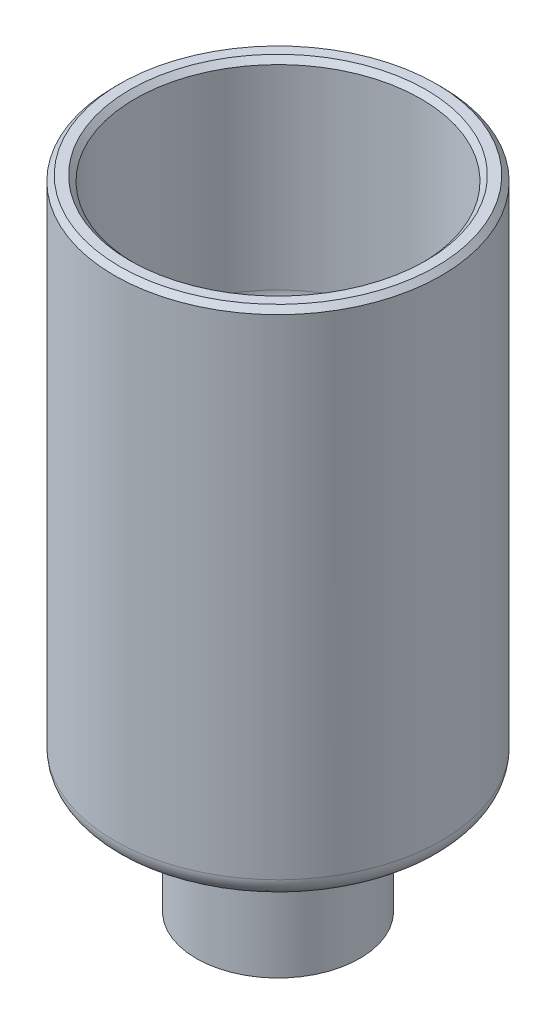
ISO-10303-21;
HEADER;
FILE_DESCRIPTION(('STEP AP214'),'2;1');
FILE_NAME('part.step','',(''),(''),'','','');
FILE_SCHEMA(('AUTOMOTIVE_DESIGN { 1 0 10303 214 1 1 1 1 }'));
ENDSEC;
DATA;
#1=APPLICATION_CONTEXT('core data for automotive mechanical design processes');
#2=APPLICATION_PROTOCOL_DEFINITION('international standard','automotive_design',2000,#1);
#3=PRODUCT_CONTEXT('',#1,'mechanical');
#4=PRODUCT('Part','Part','',(#3));
#5=PRODUCT_RELATED_PRODUCT_CATEGORY('part','',(#4));
#6=PRODUCT_DEFINITION_FORMATION('','',#4);
#7=PRODUCT_DEFINITION_CONTEXT('part definition',#1,'design');
#8=PRODUCT_DEFINITION('design','',#6,#7);
#9=PRODUCT_DEFINITION_SHAPE('','',#8);
#10=(LENGTH_UNIT() NAMED_UNIT(*) SI_UNIT(.MILLI.,.METRE.));
#11=(NAMED_UNIT(*) PLANE_ANGLE_UNIT() SI_UNIT($,.RADIAN.));
#12=(NAMED_UNIT(*) SI_UNIT($,.STERADIAN.) SOLID_ANGLE_UNIT());
#13=UNCERTAINTY_MEASURE_WITH_UNIT(LENGTH_MEASURE(1.E-05),#10,'distance_accuracy_value','');
#14=(GEOMETRIC_REPRESENTATION_CONTEXT(3) GLOBAL_UNCERTAINTY_ASSIGNED_CONTEXT((#13)) GLOBAL_UNIT_ASSIGNED_CONTEXT((#10,
#11,#12)) REPRESENTATION_CONTEXT('',''));
#15=CARTESIAN_POINT('',(0.,0.,0.));
#16=DIRECTION('',(0.,0.,1.));
#17=DIRECTION('',(1.,0.,0.));
#18=AXIS2_PLACEMENT_3D('',#15,#16,#17);
#19=CARTESIAN_POINT('',(1.7907,0.,0.));
#20=DIRECTION('',(0.,1.,0.));
#21=DIRECTION('',(0.,0.,1.));
#22=AXIS2_PLACEMENT_3D('',#19,#20,#21);
#23=PLANE('',#22);
#24=CARTESIAN_POINT('',(2.286,0.,0.));
#25=DIRECTION('',(0.,-1.,0.));
#26=DIRECTION('',(0.,0.,-1.));
#27=AXIS2_PLACEMENT_3D('',#24,#25,#26);
#28=CIRCLE('',#27,0.3175);
#29=CARTESIAN_POINT('',(2.286,0.,-0.3175));
#30=VERTEX_POINT('',#29);
#31=EDGE_CURVE('E96',#30,#30,#28,.T.);
#32=ORIENTED_EDGE('',*,*,#31,.F.);
#33=EDGE_LOOP('',(#32));
#34=FACE_BOUND('',#33,.T.);
#35=CARTESIAN_POINT('',(0.,0.,0.));
#36=DIRECTION('',(0.,1.,0.));
#37=DIRECTION('',(0.,0.,1.));
#38=AXIS2_PLACEMENT_3D('',#35,#36,#37);
#39=CIRCLE('',#38,3.175);
#40=CARTESIAN_POINT('',(0.,0.,3.175));
#41=VERTEX_POINT('',#40);
#42=EDGE_CURVE('E92',#41,#41,#39,.T.);
#43=ORIENTED_EDGE('',*,*,#42,.F.);
#44=EDGE_LOOP('',(#43));
#45=FACE_BOUND('',#44,.T.);
#46=CARTESIAN_POINT('',(0.,0.,0.));
#47=DIRECTION('',(0.,1.,0.));
#48=DIRECTION('',(0.,0.,1.));
#49=AXIS2_PLACEMENT_3D('',#46,#47,#48);
#50=CIRCLE('',#49,1.7907);
#51=CARTESIAN_POINT('',(0.,0.,1.7907));
#52=VERTEX_POINT('',#51);
#53=EDGE_CURVE('E50',#52,#52,#50,.T.);
#54=ORIENTED_EDGE('',*,*,#53,.T.);
#55=EDGE_LOOP('',(#54));
#56=FACE_BOUND('',#55,.T.);
#57=ADVANCED_FACE('F30',(#34,#45,#56),#23,.F.);
#58=CARTESIAN_POINT('',(0.,0.,0.));
#59=DIRECTION('',(0.,1.,0.));
#60=DIRECTION('',(0.,0.,1.));
#61=AXIS2_PLACEMENT_3D('',#58,#59,#60);
#62=CYLINDRICAL_SURFACE('',#61,1.7907);
#63=ORIENTED_EDGE('',*,*,#53,.F.);
#64=EDGE_LOOP('',(#63));
#65=FACE_BOUND('',#64,.T.);
#66=CARTESIAN_POINT('',(0.,8.25871274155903,0.));
#67=DIRECTION('',(0.,1.,0.));
#68=DIRECTION('',(0.,0.,1.));
#69=AXIS2_PLACEMENT_3D('',#66,#67,#68);
#70=CIRCLE('',#69,1.7907);
#71=CARTESIAN_POINT('',(0.,8.25871274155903,1.7907));
#72=VERTEX_POINT('',#71);
#73=EDGE_CURVE('E53',#72,#72,#70,.T.);
#74=ORIENTED_EDGE('',*,*,#73,.T.);
#75=EDGE_LOOP('',(#74));
#76=FACE_BOUND('',#75,.T.);
#77=ADVANCED_FACE('F113',(#65,#76),#62,.F.);
#78=CARTESIAN_POINT('',(0.,9.8425,0.));
#79=DIRECTION('',(0.,1.,0.));
#80=DIRECTION('',(0.,0.,1.));
#81=AXIS2_PLACEMENT_3D('',#78,#79,#80);
#82=CONICAL_SURFACE('',#81,2.7051,0.5235987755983);
#83=ORIENTED_EDGE('',*,*,#73,.F.);
#84=EDGE_LOOP('',(#83));
#85=FACE_BOUND('',#84,.T.);
#86=CARTESIAN_POINT('',(0.,9.8425,0.));
#87=DIRECTION('',(0.,1.,0.));
#88=DIRECTION('',(0.,0.,1.));
#89=AXIS2_PLACEMENT_3D('',#86,#87,#88);
#90=CIRCLE('',#89,2.7051);
#91=CARTESIAN_POINT('',(0.,9.8425,2.7051));
#92=VERTEX_POINT('',#91);
#93=EDGE_CURVE('E56',#92,#92,#90,.T.);
#94=ORIENTED_EDGE('',*,*,#93,.T.);
#95=EDGE_LOOP('',(#94));
#96=FACE_BOUND('',#95,.T.);
#97=ADVANCED_FACE('F121',(#85,#96),#82,.F.);
#98=CARTESIAN_POINT('',(0.,0.,0.));
#99=DIRECTION('',(0.,1.,0.));
#100=DIRECTION('',(0.,0.,1.));
#101=AXIS2_PLACEMENT_3D('',#98,#99,#100);
#102=CYLINDRICAL_SURFACE('',#101,2.7051);
#103=ORIENTED_EDGE('',*,*,#93,.F.);
#104=EDGE_LOOP('',(#103));
#105=FACE_BOUND('',#104,.T.);
#106=CARTESIAN_POINT('',(0.,16.1925,0.));
#107=DIRECTION('',(0.,1.,0.));
#108=DIRECTION('',(0.,0.,1.));
#109=AXIS2_PLACEMENT_3D('',#106,#107,#108);
#110=CIRCLE('',#109,2.7051);
#111=CARTESIAN_POINT('',(0.,16.1925,2.7051));
#112=VERTEX_POINT('',#111);
#113=EDGE_CURVE('E59',#112,#112,#110,.T.);
#114=ORIENTED_EDGE('',*,*,#113,.T.);
#115=EDGE_LOOP('',(#114));
#116=FACE_BOUND('',#115,.T.);
#117=ADVANCED_FACE('F127',(#105,#116),#102,.F.);
#118=CARTESIAN_POINT('',(2.7051,16.1925,0.));
#119=DIRECTION('',(0.,-1.,0.));
#120=DIRECTION('',(0.,0.,-1.));
#121=AXIS2_PLACEMENT_3D('',#118,#119,#120);
#122=PLANE('',#121);
#123=ORIENTED_EDGE('',*,*,#113,.F.);
#124=EDGE_LOOP('',(#123));
#125=FACE_BOUND('',#124,.T.);
#126=CARTESIAN_POINT('',(0.,16.1925,0.));
#127=DIRECTION('',(0.,1.,0.));
#128=DIRECTION('',(0.,0.,1.));
#129=AXIS2_PLACEMENT_3D('',#126,#127,#128);
#130=CIRCLE('',#129,4.7625);
#131=CARTESIAN_POINT('',(0.,16.1925,4.7625));
#132=VERTEX_POINT('',#131);
#133=EDGE_CURVE('E62',#132,#132,#130,.T.);
#134=ORIENTED_EDGE('',*,*,#133,.T.);
#135=EDGE_LOOP('',(#134));
#136=FACE_BOUND('',#135,.T.);
#137=ADVANCED_FACE('F133',(#125,#136),#122,.F.);
#138=CARTESIAN_POINT('',(0.,16.9799,0.));
#139=DIRECTION('',(0.,1.,0.));
#140=DIRECTION('',(0.,0.,1.));
#141=AXIS2_PLACEMENT_3D('',#138,#139,#140);
#142=TOROIDAL_SURFACE('',#141,4.7625,0.7874);
#143=ORIENTED_EDGE('',*,*,#133,.F.);
#144=EDGE_LOOP('',(#143));
#145=FACE_BOUND('',#144,.T.);
#146=CARTESIAN_POINT('',(0.,16.9799,0.));
#147=DIRECTION('',(0.,1.,0.));
#148=DIRECTION('',(0.,0.,1.));
#149=AXIS2_PLACEMENT_3D('',#146,#147,#148);
#150=CIRCLE('',#149,5.5499);
#151=CARTESIAN_POINT('',(0.,16.9799,5.5499));
#152=VERTEX_POINT('',#151);
#153=EDGE_CURVE('E65',#152,#152,#150,.T.);
#154=ORIENTED_EDGE('',*,*,#153,.T.);
#155=EDGE_LOOP('',(#154));
#156=FACE_BOUND('',#155,.T.);
#157=ADVANCED_FACE('F139',(#145,#156),#142,.F.);
#158=CARTESIAN_POINT('',(0.,0.,0.));
#159=DIRECTION('',(0.,1.,0.));
#160=DIRECTION('',(0.,0.,1.));
#161=AXIS2_PLACEMENT_3D('',#158,#159,#160);
#162=CYLINDRICAL_SURFACE('',#161,5.5499);
#163=CARTESIAN_POINT('',(0.,24.5618,0.));
#164=DIRECTION('',(0.,-1.,0.));
#165=DIRECTION('',(0.,0.,-1.));
#166=AXIS2_PLACEMENT_3D('',#163,#164,#165);
#167=CIRCLE('',#166,5.5499);
#168=CARTESIAN_POINT('',(0.,24.5618,-5.5499));
#169=VERTEX_POINT('',#168);
#170=EDGE_CURVE('E10',#169,#169,#167,.F.);
#171=ORIENTED_EDGE('',*,*,#170,.T.);
#172=EDGE_LOOP('',(#171));
#173=FACE_BOUND('',#172,.T.);
#174=ORIENTED_EDGE('',*,*,#153,.F.);
#175=EDGE_LOOP('',(#174));
#176=FACE_BOUND('',#175,.T.);
#177=ADVANCED_FACE('F145',(#173,#176),#162,.F.);
#178=CARTESIAN_POINT('',(5.5499,24.765,0.));
#179=DIRECTION('',(0.,-1.,0.));
#180=DIRECTION('',(0.,0.,-1.));
#181=AXIS2_PLACEMENT_3D('',#178,#179,#180);
#182=PLANE('',#181);
#183=CARTESIAN_POINT('',(0.,24.765,0.));
#184=DIRECTION('',(0.,-1.,0.));
#185=DIRECTION('',(0.,0.,-1.));
#186=AXIS2_PLACEMENT_3D('',#183,#184,#185);
#187=CIRCLE('',#186,6.14679999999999);
#188=CARTESIAN_POINT('',(0.,24.765,-6.14679999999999));
#189=VERTEX_POINT('',#188);
#190=EDGE_CURVE('E41',#189,#189,#187,.F.);
#191=ORIENTED_EDGE('',*,*,#190,.T.);
#192=EDGE_LOOP('',(#191));
#193=FACE_BOUND('',#192,.T.);
#194=CARTESIAN_POINT('',(0.,24.765,0.));
#195=DIRECTION('',(0.,-1.,0.));
#196=DIRECTION('',(0.,0.,-1.));
#197=AXIS2_PLACEMENT_3D('',#194,#195,#196);
#198=CIRCLE('',#197,5.7531);
#199=CARTESIAN_POINT('',(0.,24.765,-5.7531));
#200=VERTEX_POINT('',#199);
#201=EDGE_CURVE('E45',#200,#200,#198,.T.);
#202=ORIENTED_EDGE('',*,*,#201,.T.);
#203=EDGE_LOOP('',(#202));
#204=FACE_BOUND('',#203,.T.);
#205=ADVANCED_FACE('F150',(#193,#204),#182,.F.);
#206=CARTESIAN_POINT('',(0.,0.,0.));
#207=DIRECTION('',(0.,1.,0.));
#208=DIRECTION('',(0.,0.,1.));
#209=AXIS2_PLACEMENT_3D('',#206,#207,#208);
#210=CYLINDRICAL_SURFACE('',#209,6.35);
#211=CARTESIAN_POINT('',(0.,24.5618,0.));
#212=DIRECTION('',(0.,-1.,0.));
#213=DIRECTION('',(0.,0.,-1.));
#214=AXIS2_PLACEMENT_3D('',#211,#212,#213);
#215=CIRCLE('',#214,6.35);
#216=CARTESIAN_POINT('',(0.,24.5618,-6.35));
#217=VERTEX_POINT('',#216);
#218=EDGE_CURVE('E37',#217,#217,#215,.T.);
#219=ORIENTED_EDGE('',*,*,#218,.T.);
#220=EDGE_LOOP('',(#219));
#221=FACE_BOUND('',#220,.T.);
#222=CARTESIAN_POINT('',(0.,5.5499,0.));
#223=DIRECTION('',(0.,1.,0.));
#224=DIRECTION('',(0.,0.,1.));
#225=AXIS2_PLACEMENT_3D('',#222,#223,#224);
#226=CIRCLE('',#225,6.35);
#227=CARTESIAN_POINT('',(0.,5.5499,6.35));
#228=VERTEX_POINT('',#227);
#229=EDGE_CURVE('E68',#228,#228,#226,.T.);
#230=ORIENTED_EDGE('',*,*,#229,.T.);
#231=EDGE_LOOP('',(#230));
#232=FACE_BOUND('',#231,.T.);
#233=ADVANCED_FACE('F155',(#221,#232),#210,.T.);
#234=CARTESIAN_POINT('',(0.,5.5499,0.));
#235=DIRECTION('',(0.,1.,0.));
#236=DIRECTION('',(0.,0.,1.));
#237=AXIS2_PLACEMENT_3D('',#234,#235,#236);
#238=TOROIDAL_SURFACE('',#237,5.5626,0.7874);
#239=ORIENTED_EDGE('',*,*,#229,.F.);
#240=EDGE_LOOP('',(#239));
#241=FACE_BOUND('',#240,.T.);
#242=CARTESIAN_POINT('',(0.,4.86799159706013,0.));
#243=DIRECTION('',(0.,1.,0.));
#244=DIRECTION('',(0.,0.,1.));
#245=AXIS2_PLACEMENT_3D('',#242,#243,#244);
#246=CIRCLE('',#245,5.9563);
#247=CARTESIAN_POINT('',(0.,4.86799159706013,5.9563));
#248=VERTEX_POINT('',#247);
#249=EDGE_CURVE('E71',#248,#248,#246,.T.);
#250=ORIENTED_EDGE('',*,*,#249,.T.);
#251=EDGE_LOOP('',(#250));
#252=FACE_BOUND('',#251,.T.);
#253=ADVANCED_FACE('F202',(#241,#252),#238,.T.);
#254=CARTESIAN_POINT('',(0.,0.,0.));
#255=DIRECTION('',(0.,1.,0.));
#256=DIRECTION('',(0.,0.,1.));
#257=AXIS2_PLACEMENT_3D('',#254,#255,#256);
#258=CYLINDRICAL_SURFACE('',#257,5.9563);
#259=ORIENTED_EDGE('',*,*,#249,.F.);
#260=EDGE_LOOP('',(#259));
#261=FACE_BOUND('',#260,.T.);
#262=CARTESIAN_POINT('',(0.,6.0325,0.));
#263=DIRECTION('',(0.,1.,0.));
#264=DIRECTION('',(0.,0.,1.));
#265=AXIS2_PLACEMENT_3D('',#262,#263,#264);
#266=CIRCLE('',#265,5.9563);
#267=CARTESIAN_POINT('',(0.,6.0325,5.9563));
#268=VERTEX_POINT('',#267);
#269=EDGE_CURVE('E74',#268,#268,#266,.T.);
#270=ORIENTED_EDGE('',*,*,#269,.T.);
#271=EDGE_LOOP('',(#270));
#272=FACE_BOUND('',#271,.T.);
#273=ADVANCED_FACE('F198',(#261,#272),#258,.F.);
#274=CARTESIAN_POINT('',(3.8227,6.0325,0.));
#275=DIRECTION('',(0.,1.,0.));
#276=DIRECTION('',(0.,0.,1.));
#277=AXIS2_PLACEMENT_3D('',#274,#275,#276);
#278=PLANE('',#277);
#279=ORIENTED_EDGE('',*,*,#269,.F.);
#280=EDGE_LOOP('',(#279));
#281=FACE_BOUND('',#280,.T.);
#282=CARTESIAN_POINT('',(0.,6.0325,0.));
#283=DIRECTION('',(0.,1.,0.));
#284=DIRECTION('',(0.,0.,1.));
#285=AXIS2_PLACEMENT_3D('',#282,#283,#284);
#286=CIRCLE('',#285,3.8227);
#287=CARTESIAN_POINT('',(0.,6.0325,3.8227));
#288=VERTEX_POINT('',#287);
#289=EDGE_CURVE('E77',#288,#288,#286,.T.);
#290=ORIENTED_EDGE('',*,*,#289,.T.);
#291=EDGE_LOOP('',(#290));
#292=FACE_BOUND('',#291,.T.);
#293=ADVANCED_FACE('F194',(#281,#292),#278,.F.);
#294=CARTESIAN_POINT('',(0.,0.,0.));
#295=DIRECTION('',(0.,1.,0.));
#296=DIRECTION('',(0.,0.,1.));
#297=AXIS2_PLACEMENT_3D('',#294,#295,#296);
#298=CYLINDRICAL_SURFACE('',#297,3.8227);
#299=ORIENTED_EDGE('',*,*,#289,.F.);
#300=EDGE_LOOP('',(#299));
#301=FACE_BOUND('',#300,.T.);
#302=CARTESIAN_POINT('',(0.,4.7625,0.));
#303=DIRECTION('',(0.,1.,0.));
#304=DIRECTION('',(0.,0.,1.));
#305=AXIS2_PLACEMENT_3D('',#302,#303,#304);
#306=CIRCLE('',#305,3.8227);
#307=CARTESIAN_POINT('',(0.,4.7625,3.8227));
#308=VERTEX_POINT('',#307);
#309=EDGE_CURVE('E80',#308,#308,#306,.T.);
#310=ORIENTED_EDGE('',*,*,#309,.T.);
#311=EDGE_LOOP('',(#310));
#312=FACE_BOUND('',#311,.T.);
#313=ADVANCED_FACE('F190',(#301,#312),#298,.T.);
#314=CARTESIAN_POINT('',(3.8227,4.7625,0.));
#315=DIRECTION('',(0.,1.,0.));
#316=DIRECTION('',(0.,0.,1.));
#317=AXIS2_PLACEMENT_3D('',#314,#315,#316);
#318=PLANE('',#317);
#319=ORIENTED_EDGE('',*,*,#309,.F.);
#320=EDGE_LOOP('',(#319));
#321=FACE_BOUND('',#320,.T.);
#322=CARTESIAN_POINT('',(0.,4.7625,0.));
#323=DIRECTION('',(0.,1.,0.));
#324=DIRECTION('',(0.,0.,1.));
#325=AXIS2_PLACEMENT_3D('',#322,#323,#324);
#326=CIRCLE('',#325,2.6162);
#327=CARTESIAN_POINT('',(0.,4.7625,2.6162));
#328=VERTEX_POINT('',#327);
#329=EDGE_CURVE('E83',#328,#328,#326,.T.);
#330=ORIENTED_EDGE('',*,*,#329,.T.);
#331=EDGE_LOOP('',(#330));
#332=FACE_BOUND('',#331,.T.);
#333=ADVANCED_FACE('F186',(#321,#332),#318,.F.);
#334=CARTESIAN_POINT('',(0.,0.,0.));
#335=DIRECTION('',(0.,1.,0.));
#336=DIRECTION('',(0.,0.,1.));
#337=AXIS2_PLACEMENT_3D('',#334,#335,#336);
#338=CYLINDRICAL_SURFACE('',#337,2.6162);
#339=ORIENTED_EDGE('',*,*,#329,.F.);
#340=EDGE_LOOP('',(#339));
#341=FACE_BOUND('',#340,.T.);
#342=CARTESIAN_POINT('',(0.,3.4925,0.));
#343=DIRECTION('',(0.,1.,0.));
#344=DIRECTION('',(0.,0.,1.));
#345=AXIS2_PLACEMENT_3D('',#342,#343,#344);
#346=CIRCLE('',#345,2.6162);
#347=CARTESIAN_POINT('',(0.,3.4925,2.6162));
#348=VERTEX_POINT('',#347);
#349=EDGE_CURVE('E86',#348,#348,#346,.T.);
#350=ORIENTED_EDGE('',*,*,#349,.T.);
#351=EDGE_LOOP('',(#350));
#352=FACE_BOUND('',#351,.T.);
#353=ADVANCED_FACE('F182',(#341,#352),#338,.T.);
#354=CARTESIAN_POINT('',(3.175,3.4925,0.));
#355=DIRECTION('',(0.,-1.,0.));
#356=DIRECTION('',(0.,0.,-1.));
#357=AXIS2_PLACEMENT_3D('',#354,#355,#356);
#358=PLANE('',#357);
#359=ORIENTED_EDGE('',*,*,#349,.F.);
#360=EDGE_LOOP('',(#359));
#361=FACE_BOUND('',#360,.T.);
#362=CARTESIAN_POINT('',(0.,3.4925,0.));
#363=DIRECTION('',(0.,1.,0.));
#364=DIRECTION('',(0.,0.,1.));
#365=AXIS2_PLACEMENT_3D('',#362,#363,#364);
#366=CIRCLE('',#365,3.175);
#367=CARTESIAN_POINT('',(0.,3.4925,3.175));
#368=VERTEX_POINT('',#367);
#369=EDGE_CURVE('E89',#368,#368,#366,.T.);
#370=ORIENTED_EDGE('',*,*,#369,.T.);
#371=EDGE_LOOP('',(#370));
#372=FACE_BOUND('',#371,.T.);
#373=ADVANCED_FACE('F178',(#361,#372),#358,.F.);
#374=CARTESIAN_POINT('',(0.,0.,0.));
#375=DIRECTION('',(0.,1.,0.));
#376=DIRECTION('',(0.,0.,1.));
#377=AXIS2_PLACEMENT_3D('',#374,#375,#376);
#378=CYLINDRICAL_SURFACE('',#377,3.175);
#379=ORIENTED_EDGE('',*,*,#369,.F.);
#380=EDGE_LOOP('',(#379));
#381=FACE_BOUND('',#380,.T.);
#382=ORIENTED_EDGE('',*,*,#42,.T.);
#383=EDGE_LOOP('',(#382));
#384=FACE_BOUND('',#383,.T.);
#385=ADVANCED_FACE('F107',(#381,#384),#378,.T.);
#386=CARTESIAN_POINT('',(2.286,3.175,0.));
#387=DIRECTION('',(0.,-1.,0.));
#388=DIRECTION('',(0.,0.,-1.));
#389=AXIS2_PLACEMENT_3D('',#386,#387,#388);
#390=CYLINDRICAL_SURFACE('',#389,0.3175);
#391=CARTESIAN_POINT('',(2.286,3.175,0.));
#392=DIRECTION('',(0.,-1.,0.));
#393=DIRECTION('',(0.,0.,-1.));
#394=AXIS2_PLACEMENT_3D('',#391,#392,#393);
#395=CIRCLE('',#394,0.3175);
#396=CARTESIAN_POINT('',(2.286,3.175,-0.3175));
#397=VERTEX_POINT('',#396);
#398=EDGE_CURVE('E95',#397,#397,#395,.T.);
#399=ORIENTED_EDGE('',*,*,#398,.F.);
#400=EDGE_LOOP('',(#399));
#401=FACE_BOUND('',#400,.T.);
#402=ORIENTED_EDGE('',*,*,#31,.T.);
#403=EDGE_LOOP('',(#402));
#404=FACE_BOUND('',#403,.T.);
#405=ADVANCED_FACE('F104',(#401,#404),#390,.F.);
#406=CARTESIAN_POINT('',(2.286,3.175,0.));
#407=DIRECTION('',(0.,-1.,0.));
#408=DIRECTION('',(0.,0.,-1.));
#409=AXIS2_PLACEMENT_3D('',#406,#407,#408);
#410=PLANE('',#409);
#411=ORIENTED_EDGE('',*,*,#398,.T.);
#412=EDGE_LOOP('',(#411));
#413=FACE_BOUND('',#412,.T.);
#414=ADVANCED_FACE('F102',(#413),#410,.T.);
#415=CARTESIAN_POINT('',(0.,24.765,0.));
#416=DIRECTION('',(0.,-1.,0.));
#417=DIRECTION('',(0.,0.,-1.));
#418=AXIS2_PLACEMENT_3D('',#415,#416,#417);
#419=CONICAL_SURFACE('',#418,6.14679999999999,0.785398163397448);
#420=ORIENTED_EDGE('',*,*,#218,.F.);
#421=EDGE_LOOP('',(#420));
#422=FACE_BOUND('',#421,.T.);
#423=ORIENTED_EDGE('',*,*,#190,.F.);
#424=EDGE_LOOP('',(#423));
#425=FACE_BOUND('',#424,.T.);
#426=ADVANCED_FACE('F159',(#422,#425),#419,.T.);
#427=CARTESIAN_POINT('',(0.,24.5618,0.));
#428=DIRECTION('',(0.,1.,0.));
#429=DIRECTION('',(0.,0.,1.));
#430=AXIS2_PLACEMENT_3D('',#427,#428,#429);
#431=CONICAL_SURFACE('',#430,5.5499,0.785398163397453);
#432=ORIENTED_EDGE('',*,*,#201,.F.);
#433=EDGE_LOOP('',(#432));
#434=FACE_BOUND('',#433,.T.);
#435=ORIENTED_EDGE('',*,*,#170,.F.);
#436=EDGE_LOOP('',(#435));
#437=FACE_BOUND('',#436,.T.);
#438=ADVANCED_FACE('F32',(#434,#437),#431,.F.);
#439=CLOSED_SHELL('',(#57,#77,#97,#117,#137,#157,#177,#205,#233,#253,#273,#293,#313,#333,#353,
#373,#385,#405,#414,#426,#438));
#440=MANIFOLD_SOLID_BREP('B2',#439);
#441=ADVANCED_BREP_SHAPE_REPRESENTATION('',(#18,#440),#14);
#442=SHAPE_DEFINITION_REPRESENTATION(#9,#441);
ENDSEC;
END-ISO-10303-21;
